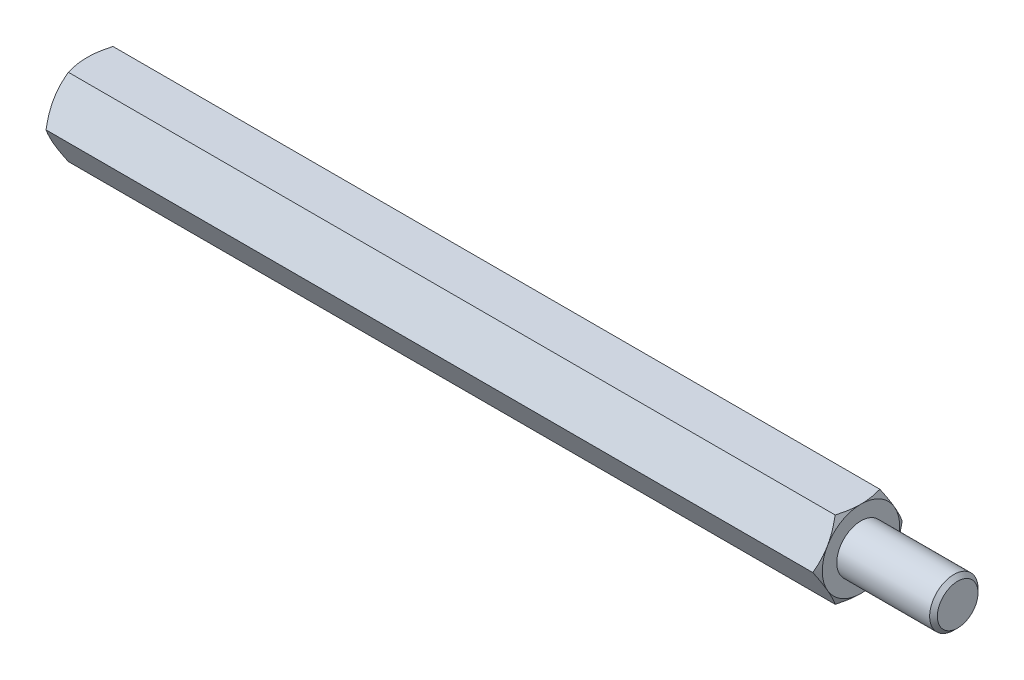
from build123d import *

# Parameters (mm, degrees)
EXTRUDE2_DEPTH = 40
SKETCH3_R      = 2.1
EXTRUDE3_DEPTH = 10
SKETCH5_R      = 2.5
EXTRUDE4_DEPTH = 10
CHAMFER1_SIZE  = 0.4


with BuildPart() as part:
    # Sketch1 → Extrude2 (new, symmetric)
    with BuildSketch(Plane(origin=(0, 0, 0), x_dir=(0, 0, -1), z_dir=(1, 0, 0))):
        Polygon((2.309401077, 4), (-2.309401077, 4), (-4.618802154, 0), (-2.309401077, -4), (2.309401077, -4), (4.618802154, 0), align=None)
    extrude(amount=EXTRUDE2_DEPTH, both=True)

    # Sketch2 → Cut-Revolve1 (revolve, cut)
    with BuildSketch(Plane.XY):
        with BuildLine():
            Line((-40, 4), (-38.5, 6.598076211))
            ThreePointArc((-38.5, 6.598076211), (-38.98810136, 7.776457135), (-40, 7))
            Line((-40, 7), (-40, 4))
        make_face()
    cut_revolve1 = revolve(axis=Axis((0, 0, 0), (1, 0, 0)), mode=Mode.SUBTRACT)

    # Mirror1: Cut-Revolve1 across plane
    add(cut_revolve1.mirror(Plane(origin=(0, 0, 0), x_dir=(0, 0, 1), z_dir=(1, 0, 0))), mode=Mode.SUBTRACT)

    # Sketch3 → Extrude3 (cut)
    with BuildSketch(Plane.ZY.offset(40)):
        Circle(SKETCH3_R)
    extrude(amount=-EXTRUDE3_DEPTH, mode=Mode.SUBTRACT)

    # Sketch4 → Cut-Revolve2 (revolve, cut)
    with BuildSketch(Plane.XY, mode=Mode.PRIVATE) as cut_revolve2_sk:
        Polygon((-30, 0), (-30, 2.1), (-28.787564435, 0), align=None)
    revolve(cut_revolve2_sk.sketch.rotate(Axis((-28.787564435, 0, 0), (-1, 0, 0)), 180), axis=Axis((-28.787564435, 0, 0), (-1, 0, 0)), mode=Mode.SUBTRACT)

    # Sketch5 → Extrude4 (add)
    with BuildSketch(Plane(origin=(40, 0, 0), x_dir=(0, 0, -1), z_dir=(1, 0, 0))):
        Circle(SKETCH5_R)
    extrude(amount=EXTRUDE4_DEPTH)

    # Chamfer1
    chamfer1_edges = [part.edges().sort_by_distance(p)[0] for p in [
        (50, 0, 2.5),
    ]]
    chamfer(chamfer1_edges, length=CHAMFER1_SIZE)


solid = part.part
